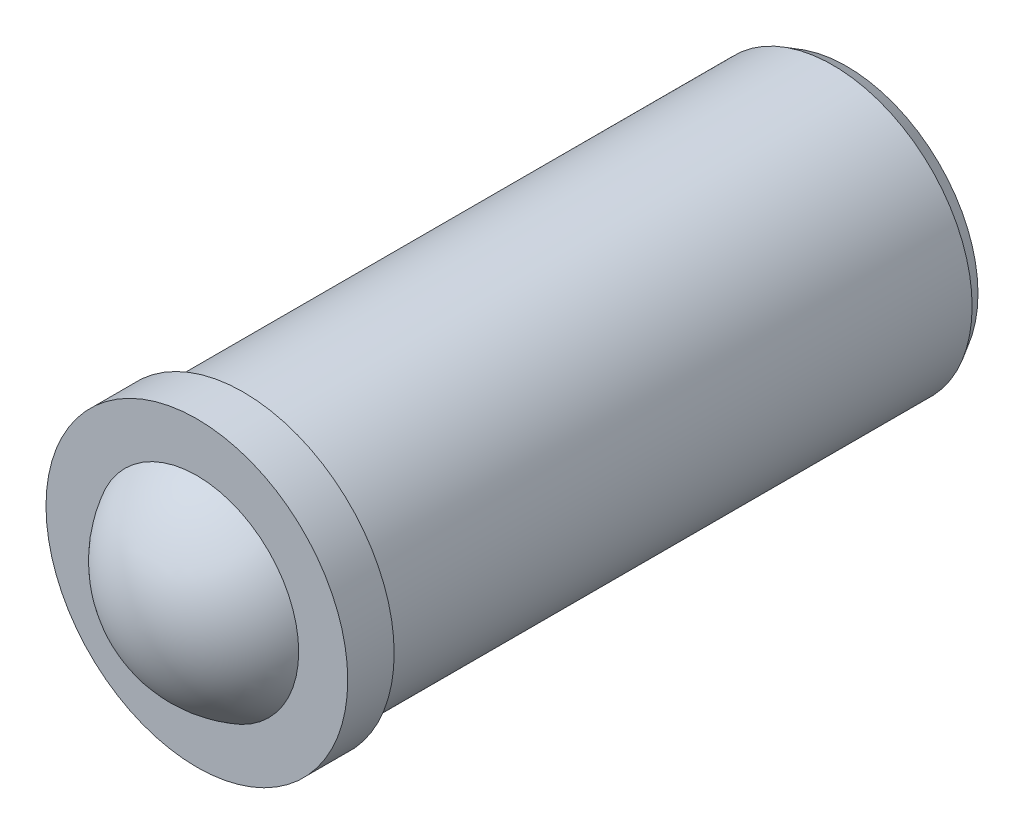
ISO-10303-21;
HEADER;
FILE_DESCRIPTION(('STEP AP214'),'2;1');
FILE_NAME('part.step','',(''),(''),'','','');
FILE_SCHEMA(('AUTOMOTIVE_DESIGN { 1 0 10303 214 1 1 1 1 }'));
ENDSEC;
DATA;
#1=APPLICATION_CONTEXT('core data for automotive mechanical design processes');
#2=APPLICATION_PROTOCOL_DEFINITION('international standard','automotive_design',2000,#1);
#3=PRODUCT_CONTEXT('',#1,'mechanical');
#4=PRODUCT('Part','Part','',(#3));
#5=PRODUCT_RELATED_PRODUCT_CATEGORY('part','',(#4));
#6=PRODUCT_DEFINITION_FORMATION('','',#4);
#7=PRODUCT_DEFINITION_CONTEXT('part definition',#1,'design');
#8=PRODUCT_DEFINITION('design','',#6,#7);
#9=PRODUCT_DEFINITION_SHAPE('','',#8);
#10=(LENGTH_UNIT() NAMED_UNIT(*) SI_UNIT(.MILLI.,.METRE.));
#11=(NAMED_UNIT(*) PLANE_ANGLE_UNIT() SI_UNIT($,.RADIAN.));
#12=(NAMED_UNIT(*) SI_UNIT($,.STERADIAN.) SOLID_ANGLE_UNIT());
#13=UNCERTAINTY_MEASURE_WITH_UNIT(LENGTH_MEASURE(1.E-05),#10,'distance_accuracy_value','');
#14=(GEOMETRIC_REPRESENTATION_CONTEXT(3) GLOBAL_UNCERTAINTY_ASSIGNED_CONTEXT((#13)) GLOBAL_UNIT_ASSIGNED_CONTEXT((#10,
#11,#12)) REPRESENTATION_CONTEXT('',''));
#15=CARTESIAN_POINT('',(0.,0.,0.));
#16=DIRECTION('',(0.,0.,1.));
#17=DIRECTION('',(1.,0.,0.));
#18=AXIS2_PLACEMENT_3D('',#15,#16,#17);
#19=CARTESIAN_POINT('',(0.,0.,1.));
#20=DIRECTION('',(0.,0.,1.));
#21=DIRECTION('',(-1.,0.,0.));
#22=AXIS2_PLACEMENT_3D('',#19,#20,#21);
#23=CYLINDRICAL_SURFACE('',#22,3.);
#24=CARTESIAN_POINT('',(0.,0.,-12.7));
#25=DIRECTION('',(0.,0.,1.));
#26=DIRECTION('',(1.,0.,0.));
#27=AXIS2_PLACEMENT_3D('',#24,#25,#26);
#28=CIRCLE('',#27,3.);
#29=CARTESIAN_POINT('',(3.,0.,-12.7));
#30=VERTEX_POINT('',#29);
#31=EDGE_CURVE('E19',#30,#30,#28,.T.);
#32=ORIENTED_EDGE('',*,*,#31,.T.);
#33=EDGE_LOOP('',(#32));
#34=FACE_BOUND('',#33,.T.);
#35=CARTESIAN_POINT('',(0.,0.,0.));
#36=DIRECTION('',(0.,0.,1.));
#37=DIRECTION('',(-1.,0.,0.));
#38=AXIS2_PLACEMENT_3D('',#35,#36,#37);
#39=CIRCLE('',#38,3.);
#40=CARTESIAN_POINT('',(-3.,0.,0.));
#41=VERTEX_POINT('',#40);
#42=EDGE_CURVE('E27',#41,#41,#39,.T.);
#43=ORIENTED_EDGE('',*,*,#42,.F.);
#44=EDGE_LOOP('',(#43));
#45=FACE_BOUND('',#44,.T.);
#46=ADVANCED_FACE('F12',(#34,#45),#23,.T.);
#47=CARTESIAN_POINT('',(-3.,0.,0.));
#48=DIRECTION('',(0.,0.,1.));
#49=DIRECTION('',(-1.,0.,0.));
#50=AXIS2_PLACEMENT_3D('',#47,#48,#49);
#51=PLANE('',#50);
#52=CARTESIAN_POINT('',(0.,0.,0.));
#53=DIRECTION('',(0.,0.,1.));
#54=DIRECTION('',(-1.,0.,0.));
#55=AXIS2_PLACEMENT_3D('',#52,#53,#54);
#56=CIRCLE('',#55,3.25);
#57=CARTESIAN_POINT('',(-3.25,0.,0.));
#58=VERTEX_POINT('',#57);
#59=EDGE_CURVE('E32',#58,#58,#56,.T.);
#60=ORIENTED_EDGE('',*,*,#59,.F.);
#61=EDGE_LOOP('',(#60));
#62=FACE_BOUND('',#61,.T.);
#63=ORIENTED_EDGE('',*,*,#42,.T.);
#64=EDGE_LOOP('',(#63));
#65=FACE_BOUND('',#64,.T.);
#66=ADVANCED_FACE('F45',(#62,#65),#51,.F.);
#67=CARTESIAN_POINT('',(0.,0.,1.));
#68=DIRECTION('',(0.,0.,1.));
#69=DIRECTION('',(-1.,0.,0.));
#70=AXIS2_PLACEMENT_3D('',#67,#68,#69);
#71=CYLINDRICAL_SURFACE('',#70,3.25);
#72=CARTESIAN_POINT('',(0.,0.,1.));
#73=DIRECTION('',(0.,0.,1.));
#74=DIRECTION('',(-1.,0.,0.));
#75=AXIS2_PLACEMENT_3D('',#72,#73,#74);
#76=CIRCLE('',#75,3.25);
#77=CARTESIAN_POINT('',(-3.25,0.,1.));
#78=VERTEX_POINT('',#77);
#79=EDGE_CURVE('E35',#78,#78,#76,.T.);
#80=ORIENTED_EDGE('',*,*,#79,.F.);
#81=EDGE_LOOP('',(#80));
#82=FACE_BOUND('',#81,.T.);
#83=ORIENTED_EDGE('',*,*,#59,.T.);
#84=EDGE_LOOP('',(#83));
#85=FACE_BOUND('',#84,.T.);
#86=ADVANCED_FACE('F42',(#82,#85),#71,.T.);
#87=CARTESIAN_POINT('',(-3.25,0.,1.));
#88=DIRECTION('',(0.,0.,-1.));
#89=DIRECTION('',(1.,0.,0.));
#90=AXIS2_PLACEMENT_3D('',#87,#88,#89);
#91=PLANE('',#90);
#92=ORIENTED_EDGE('',*,*,#79,.T.);
#93=EDGE_LOOP('',(#92));
#94=FACE_BOUND('',#93,.T.);
#95=CARTESIAN_POINT('',(0.,0.,1.));
#96=DIRECTION('',(0.,0.,1.));
#97=DIRECTION('',(-1.,0.,0.));
#98=AXIS2_PLACEMENT_3D('',#95,#96,#97);
#99=CIRCLE('',#98,2.19317121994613);
#100=CARTESIAN_POINT('',(-2.19317121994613,0.,1.));
#101=VERTEX_POINT('',#100);
#102=EDGE_CURVE('E23',#101,#101,#99,.F.);
#103=ORIENTED_EDGE('',*,*,#102,.T.);
#104=EDGE_LOOP('',(#103));
#105=FACE_BOUND('',#104,.T.);
#106=ADVANCED_FACE('F39',(#94,#105),#91,.F.);
#107=CARTESIAN_POINT('',(0.,0.,-0.2));
#108=DIRECTION('',(0.,0.,-1.));
#109=DIRECTION('',(-1.,0.,0.));
#110=AXIS2_PLACEMENT_3D('',#107,#108,#109);
#111=SPHERICAL_SURFACE('',#110,2.5);
#112=ORIENTED_EDGE('',*,*,#102,.F.);
#113=EDGE_LOOP('',(#112));
#114=FACE_BOUND('',#113,.T.);
#115=ADVANCED_FACE('F61',(#114),#111,.T.);
#116=CARTESIAN_POINT('',(0.,0.,-13.));
#117=DIRECTION('',(0.,0.,1.));
#118=DIRECTION('',(1.,0.,0.));
#119=AXIS2_PLACEMENT_3D('',#116,#117,#118);
#120=PLANE('',#119);
#121=CARTESIAN_POINT('',(0.,0.,-13.));
#122=DIRECTION('',(0.,0.,1.));
#123=DIRECTION('',(1.,0.,0.));
#124=AXIS2_PLACEMENT_3D('',#121,#122,#123);
#125=CIRCLE('',#124,2.82679491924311);
#126=CARTESIAN_POINT('',(2.82679491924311,0.,-13.));
#127=VERTEX_POINT('',#126);
#128=EDGE_CURVE('E8',#127,#127,#125,.F.);
#129=ORIENTED_EDGE('',*,*,#128,.T.);
#130=EDGE_LOOP('',(#129));
#131=FACE_BOUND('',#130,.T.);
#132=ADVANCED_FACE('F64',(#131),#120,.F.);
#133=CARTESIAN_POINT('',(0.,0.,-12.7));
#134=DIRECTION('',(0.,0.,1.));
#135=DIRECTION('',(1.,0.,0.));
#136=AXIS2_PLACEMENT_3D('',#133,#134,#135);
#137=CONICAL_SURFACE('',#136,3.,0.523598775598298);
#138=ORIENTED_EDGE('',*,*,#128,.F.);
#139=EDGE_LOOP('',(#138));
#140=FACE_BOUND('',#139,.T.);
#141=ORIENTED_EDGE('',*,*,#31,.F.);
#142=EDGE_LOOP('',(#141));
#143=FACE_BOUND('',#142,.T.);
#144=ADVANCED_FACE('F14',(#140,#143),#137,.T.);
#145=CLOSED_SHELL('',(#46,#66,#86,#106,#115,#132,#144));
#146=MANIFOLD_SOLID_BREP('B1',#145);
#147=ADVANCED_BREP_SHAPE_REPRESENTATION('',(#18,#146),#14);
#148=SHAPE_DEFINITION_REPRESENTATION(#9,#147);
ENDSEC;
END-ISO-10303-21;
